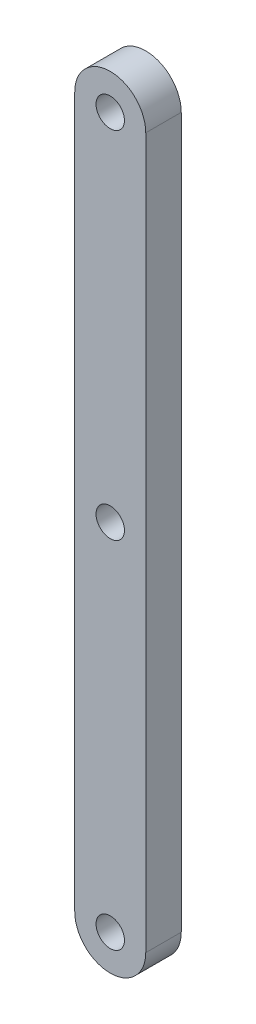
ISO-10303-21;
HEADER;
FILE_DESCRIPTION(('STEP AP214'),'2;1');
FILE_NAME('part.step','',(''),(''),'','','');
FILE_SCHEMA(('AUTOMOTIVE_DESIGN { 1 0 10303 214 1 1 1 1 }'));
ENDSEC;
DATA;
#1=APPLICATION_CONTEXT('core data for automotive mechanical design processes');
#2=APPLICATION_PROTOCOL_DEFINITION('international standard','automotive_design',2000,#1);
#3=PRODUCT_CONTEXT('',#1,'mechanical');
#4=PRODUCT('Part','Part','',(#3));
#5=PRODUCT_RELATED_PRODUCT_CATEGORY('part','',(#4));
#6=PRODUCT_DEFINITION_FORMATION('','',#4);
#7=PRODUCT_DEFINITION_CONTEXT('part definition',#1,'design');
#8=PRODUCT_DEFINITION('design','',#6,#7);
#9=PRODUCT_DEFINITION_SHAPE('','',#8);
#10=(LENGTH_UNIT() NAMED_UNIT(*) SI_UNIT(.MILLI.,.METRE.));
#11=(NAMED_UNIT(*) PLANE_ANGLE_UNIT() SI_UNIT($,.RADIAN.));
#12=(NAMED_UNIT(*) SI_UNIT($,.STERADIAN.) SOLID_ANGLE_UNIT());
#13=UNCERTAINTY_MEASURE_WITH_UNIT(LENGTH_MEASURE(1.E-05),#10,'distance_accuracy_value','');
#14=(GEOMETRIC_REPRESENTATION_CONTEXT(3) GLOBAL_UNCERTAINTY_ASSIGNED_CONTEXT((#13)) GLOBAL_UNIT_ASSIGNED_CONTEXT((#10,
#11,#12)) REPRESENTATION_CONTEXT('',''));
#15=CARTESIAN_POINT('',(0.,0.,0.));
#16=DIRECTION('',(0.,0.,1.));
#17=DIRECTION('',(1.,0.,0.));
#18=AXIS2_PLACEMENT_3D('',#15,#16,#17);
#19=CARTESIAN_POINT('',(0.,0.,5.));
#20=DIRECTION('',(0.,0.,1.));
#21=DIRECTION('',(1.,0.,0.));
#22=AXIS2_PLACEMENT_3D('',#19,#20,#21);
#23=PLANE('',#22);
#24=CARTESIAN_POINT('',(0.,0.,5.));
#25=DIRECTION('',(0.,0.,1.));
#26=DIRECTION('',(1.,0.,0.));
#27=AXIS2_PLACEMENT_3D('',#24,#25,#26);
#28=CIRCLE('',#27,2.);
#29=CARTESIAN_POINT('',(2.,0.,5.));
#30=VERTEX_POINT('',#29);
#31=EDGE_CURVE('E140',#30,#30,#28,.T.);
#32=ORIENTED_EDGE('',*,*,#31,.F.);
#33=EDGE_LOOP('',(#32));
#34=FACE_BOUND('',#33,.T.);
#35=CARTESIAN_POINT('',(0.,0.,5.));
#36=DIRECTION('',(0.,0.,1.));
#37=DIRECTION('',(1.,0.,0.));
#38=AXIS2_PLACEMENT_3D('',#35,#36,#37);
#39=CIRCLE('',#38,5.);
#40=CARTESIAN_POINT('',(-5.,0.,5.));
#41=VERTEX_POINT('',#40);
#42=CARTESIAN_POINT('',(5.,0.,5.));
#43=VERTEX_POINT('',#42);
#44=EDGE_CURVE('E98',#41,#43,#39,.T.);
#45=ORIENTED_EDGE('',*,*,#44,.T.);
#46=DIRECTION('',(0.,1.,0.));
#47=VECTOR('',#46,1.);
#48=CARTESIAN_POINT('',(5.,0.,5.));
#49=LINE('',#48,#47);
#50=CARTESIAN_POINT('',(5.,100.,5.));
#51=VERTEX_POINT('',#50);
#52=EDGE_CURVE('E93',#43,#51,#49,.T.);
#53=ORIENTED_EDGE('',*,*,#52,.T.);
#54=CARTESIAN_POINT('',(0.,100.,5.));
#55=DIRECTION('',(0.,0.,1.));
#56=DIRECTION('',(1.,0.,0.));
#57=AXIS2_PLACEMENT_3D('',#54,#55,#56);
#58=CIRCLE('',#57,5.);
#59=CARTESIAN_POINT('',(-5.,100.,5.));
#60=VERTEX_POINT('',#59);
#61=EDGE_CURVE('E96',#51,#60,#58,.T.);
#62=ORIENTED_EDGE('',*,*,#61,.T.);
#63=DIRECTION('',(0.,-1.,0.));
#64=VECTOR('',#63,1.);
#65=CARTESIAN_POINT('',(-5.,0.,5.));
#66=LINE('',#65,#64);
#67=EDGE_CURVE('E63',#60,#41,#66,.T.);
#68=ORIENTED_EDGE('',*,*,#67,.T.);
#69=EDGE_LOOP('',(#45,#53,#62,#68));
#70=FACE_BOUND('',#69,.T.);
#71=CARTESIAN_POINT('',(0.,100.,5.));
#72=DIRECTION('',(0.,0.,1.));
#73=DIRECTION('',(1.,0.,0.));
#74=AXIS2_PLACEMENT_3D('',#71,#72,#73);
#75=CIRCLE('',#74,2.);
#76=CARTESIAN_POINT('',(2.,100.,5.));
#77=VERTEX_POINT('',#76);
#78=EDGE_CURVE('E118',#77,#77,#75,.T.);
#79=ORIENTED_EDGE('',*,*,#78,.F.);
#80=EDGE_LOOP('',(#79));
#81=FACE_BOUND('',#80,.T.);
#82=CARTESIAN_POINT('',(0.,50.,5.));
#83=DIRECTION('',(0.,0.,1.));
#84=DIRECTION('',(1.,0.,0.));
#85=AXIS2_PLACEMENT_3D('',#82,#83,#84);
#86=CIRCLE('',#85,2.);
#87=CARTESIAN_POINT('',(2.,50.,5.));
#88=VERTEX_POINT('',#87);
#89=EDGE_CURVE('E148',#88,#88,#86,.T.);
#90=ORIENTED_EDGE('',*,*,#89,.F.);
#91=EDGE_LOOP('',(#90));
#92=FACE_BOUND('',#91,.T.);
#93=ADVANCED_FACE('F45',(#34,#70,#81,#92),#23,.T.);
#94=CARTESIAN_POINT('',(0.,0.,0.));
#95=DIRECTION('',(0.,0.,1.));
#96=DIRECTION('',(1.,0.,0.));
#97=AXIS2_PLACEMENT_3D('',#94,#95,#96);
#98=PLANE('',#97);
#99=CARTESIAN_POINT('',(0.,0.,0.));
#100=DIRECTION('',(0.,0.,1.));
#101=DIRECTION('',(1.,0.,0.));
#102=AXIS2_PLACEMENT_3D('',#99,#100,#101);
#103=CIRCLE('',#102,5.);
#104=CARTESIAN_POINT('',(-5.,0.,0.));
#105=VERTEX_POINT('',#104);
#106=CARTESIAN_POINT('',(5.,0.,0.));
#107=VERTEX_POINT('',#106);
#108=EDGE_CURVE('E114',#105,#107,#103,.T.);
#109=ORIENTED_EDGE('',*,*,#108,.F.);
#110=DIRECTION('',(0.,-1.,0.));
#111=VECTOR('',#110,1.);
#112=CARTESIAN_POINT('',(-5.,0.,0.));
#113=LINE('',#112,#111);
#114=CARTESIAN_POINT('',(-5.,100.,0.));
#115=VERTEX_POINT('',#114);
#116=EDGE_CURVE('E86',#115,#105,#113,.T.);
#117=ORIENTED_EDGE('',*,*,#116,.F.);
#118=CARTESIAN_POINT('',(0.,100.,0.));
#119=DIRECTION('',(0.,0.,1.));
#120=DIRECTION('',(1.,0.,0.));
#121=AXIS2_PLACEMENT_3D('',#118,#119,#120);
#122=CIRCLE('',#121,5.);
#123=CARTESIAN_POINT('',(5.,100.,0.));
#124=VERTEX_POINT('',#123);
#125=EDGE_CURVE('E80',#124,#115,#122,.T.);
#126=ORIENTED_EDGE('',*,*,#125,.F.);
#127=DIRECTION('',(0.,1.,0.));
#128=VECTOR('',#127,1.);
#129=CARTESIAN_POINT('',(5.,0.,0.));
#130=LINE('',#129,#128);
#131=EDGE_CURVE('E103',#107,#124,#130,.T.);
#132=ORIENTED_EDGE('',*,*,#131,.F.);
#133=EDGE_LOOP('',(#109,#117,#126,#132));
#134=FACE_BOUND('',#133,.T.);
#135=CARTESIAN_POINT('',(0.,100.,0.));
#136=DIRECTION('',(0.,0.,1.));
#137=DIRECTION('',(1.,0.,0.));
#138=AXIS2_PLACEMENT_3D('',#135,#136,#137);
#139=CIRCLE('',#138,2.);
#140=CARTESIAN_POINT('',(2.,100.,0.));
#141=VERTEX_POINT('',#140);
#142=EDGE_CURVE('E136',#141,#141,#139,.T.);
#143=ORIENTED_EDGE('',*,*,#142,.T.);
#144=EDGE_LOOP('',(#143));
#145=FACE_BOUND('',#144,.T.);
#146=CARTESIAN_POINT('',(0.,0.,0.));
#147=DIRECTION('',(0.,0.,1.));
#148=DIRECTION('',(1.,0.,0.));
#149=AXIS2_PLACEMENT_3D('',#146,#147,#148);
#150=CIRCLE('',#149,2.);
#151=CARTESIAN_POINT('',(2.,0.,0.));
#152=VERTEX_POINT('',#151);
#153=EDGE_CURVE('E144',#152,#152,#150,.T.);
#154=ORIENTED_EDGE('',*,*,#153,.T.);
#155=EDGE_LOOP('',(#154));
#156=FACE_BOUND('',#155,.T.);
#157=CARTESIAN_POINT('',(0.,50.,0.));
#158=DIRECTION('',(0.,0.,1.));
#159=DIRECTION('',(1.,0.,0.));
#160=AXIS2_PLACEMENT_3D('',#157,#158,#159);
#161=CIRCLE('',#160,2.);
#162=CARTESIAN_POINT('',(2.,50.,0.));
#163=VERTEX_POINT('',#162);
#164=EDGE_CURVE('E152',#163,#163,#161,.T.);
#165=ORIENTED_EDGE('',*,*,#164,.T.);
#166=EDGE_LOOP('',(#165));
#167=FACE_BOUND('',#166,.T.);
#168=ADVANCED_FACE('F131',(#134,#145,#156,#167),#98,.F.);
#169=CARTESIAN_POINT('',(0.,0.,5.));
#170=DIRECTION('',(0.,0.,-1.));
#171=DIRECTION('',(-1.,0.,0.));
#172=AXIS2_PLACEMENT_3D('',#169,#170,#171);
#173=CYLINDRICAL_SURFACE('',#172,5.);
#174=ORIENTED_EDGE('',*,*,#108,.T.);
#175=DIRECTION('',(0.,0.,-1.));
#176=VECTOR('',#175,1.);
#177=CARTESIAN_POINT('',(5.,0.,5.));
#178=LINE('',#177,#176);
#179=EDGE_CURVE('E11',#43,#107,#178,.T.);
#180=ORIENTED_EDGE('',*,*,#179,.F.);
#181=ORIENTED_EDGE('',*,*,#44,.F.);
#182=DIRECTION('',(0.,0.,-1.));
#183=VECTOR('',#182,1.);
#184=CARTESIAN_POINT('',(-5.,0.,5.));
#185=LINE('',#184,#183);
#186=EDGE_CURVE('E110',#41,#105,#185,.T.);
#187=ORIENTED_EDGE('',*,*,#186,.T.);
#188=EDGE_LOOP('',(#174,#180,#181,#187));
#189=FACE_BOUND('',#188,.T.);
#190=ADVANCED_FACE('F47',(#189),#173,.T.);
#191=CARTESIAN_POINT('',(5.,0.,5.));
#192=DIRECTION('',(-1.,0.,0.));
#193=DIRECTION('',(0.,0.,1.));
#194=AXIS2_PLACEMENT_3D('',#191,#192,#193);
#195=PLANE('',#194);
#196=ORIENTED_EDGE('',*,*,#131,.T.);
#197=DIRECTION('',(0.,0.,-1.));
#198=VECTOR('',#197,1.);
#199=CARTESIAN_POINT('',(5.,100.,5.));
#200=LINE('',#199,#198);
#201=EDGE_CURVE('E55',#51,#124,#200,.T.);
#202=ORIENTED_EDGE('',*,*,#201,.F.);
#203=ORIENTED_EDGE('',*,*,#52,.F.);
#204=ORIENTED_EDGE('',*,*,#179,.T.);
#205=EDGE_LOOP('',(#196,#202,#203,#204));
#206=FACE_BOUND('',#205,.T.);
#207=ADVANCED_FACE('F102',(#206),#195,.F.);
#208=CARTESIAN_POINT('',(0.,100.,5.));
#209=DIRECTION('',(0.,0.,-1.));
#210=DIRECTION('',(-1.,0.,0.));
#211=AXIS2_PLACEMENT_3D('',#208,#209,#210);
#212=CYLINDRICAL_SURFACE('',#211,5.);
#213=ORIENTED_EDGE('',*,*,#125,.T.);
#214=DIRECTION('',(0.,0.,-1.));
#215=VECTOR('',#214,1.);
#216=CARTESIAN_POINT('',(-5.,100.,5.));
#217=LINE('',#216,#215);
#218=EDGE_CURVE('E105',#60,#115,#217,.T.);
#219=ORIENTED_EDGE('',*,*,#218,.F.);
#220=ORIENTED_EDGE('',*,*,#61,.F.);
#221=ORIENTED_EDGE('',*,*,#201,.T.);
#222=EDGE_LOOP('',(#213,#219,#220,#221));
#223=FACE_BOUND('',#222,.T.);
#224=ADVANCED_FACE('F106',(#223),#212,.T.);
#225=CARTESIAN_POINT('',(-5.,0.,5.));
#226=DIRECTION('',(1.,0.,0.));
#227=DIRECTION('',(0.,0.,-1.));
#228=AXIS2_PLACEMENT_3D('',#225,#226,#227);
#229=PLANE('',#228);
#230=ORIENTED_EDGE('',*,*,#116,.T.);
#231=ORIENTED_EDGE('',*,*,#186,.F.);
#232=ORIENTED_EDGE('',*,*,#67,.F.);
#233=ORIENTED_EDGE('',*,*,#218,.T.);
#234=EDGE_LOOP('',(#230,#231,#232,#233));
#235=FACE_BOUND('',#234,.T.);
#236=ADVANCED_FACE('F128',(#235),#229,.F.);
#237=CARTESIAN_POINT('',(0.,100.,5.));
#238=DIRECTION('',(0.,0.,-1.));
#239=DIRECTION('',(-1.,0.,0.));
#240=AXIS2_PLACEMENT_3D('',#237,#238,#239);
#241=CYLINDRICAL_SURFACE('',#240,2.);
#242=ORIENTED_EDGE('',*,*,#78,.T.);
#243=EDGE_LOOP('',(#242));
#244=FACE_BOUND('',#243,.T.);
#245=ORIENTED_EDGE('',*,*,#142,.F.);
#246=EDGE_LOOP('',(#245));
#247=FACE_BOUND('',#246,.T.);
#248=ADVANCED_FACE('F172',(#244,#247),#241,.F.);
#249=CARTESIAN_POINT('',(0.,0.,5.));
#250=DIRECTION('',(0.,0.,-1.));
#251=DIRECTION('',(-1.,0.,0.));
#252=AXIS2_PLACEMENT_3D('',#249,#250,#251);
#253=CYLINDRICAL_SURFACE('',#252,2.);
#254=ORIENTED_EDGE('',*,*,#31,.T.);
#255=EDGE_LOOP('',(#254));
#256=FACE_BOUND('',#255,.T.);
#257=ORIENTED_EDGE('',*,*,#153,.F.);
#258=EDGE_LOOP('',(#257));
#259=FACE_BOUND('',#258,.T.);
#260=ADVANCED_FACE('F217',(#256,#259),#253,.F.);
#261=CARTESIAN_POINT('',(0.,50.,5.));
#262=DIRECTION('',(0.,0.,-1.));
#263=DIRECTION('',(-1.,0.,0.));
#264=AXIS2_PLACEMENT_3D('',#261,#262,#263);
#265=CYLINDRICAL_SURFACE('',#264,2.);
#266=ORIENTED_EDGE('',*,*,#89,.T.);
#267=EDGE_LOOP('',(#266));
#268=FACE_BOUND('',#267,.T.);
#269=ORIENTED_EDGE('',*,*,#164,.F.);
#270=EDGE_LOOP('',(#269));
#271=FACE_BOUND('',#270,.T.);
#272=ADVANCED_FACE('F160',(#268,#271),#265,.F.);
#273=CLOSED_SHELL('',(#93,#168,#190,#207,#224,#236,#248,#260,#272));
#274=MANIFOLD_SOLID_BREP('B2',#273);
#275=ADVANCED_BREP_SHAPE_REPRESENTATION('',(#18,#274),#14);
#276=SHAPE_DEFINITION_REPRESENTATION(#9,#275);
ENDSEC;
END-ISO-10303-21;
